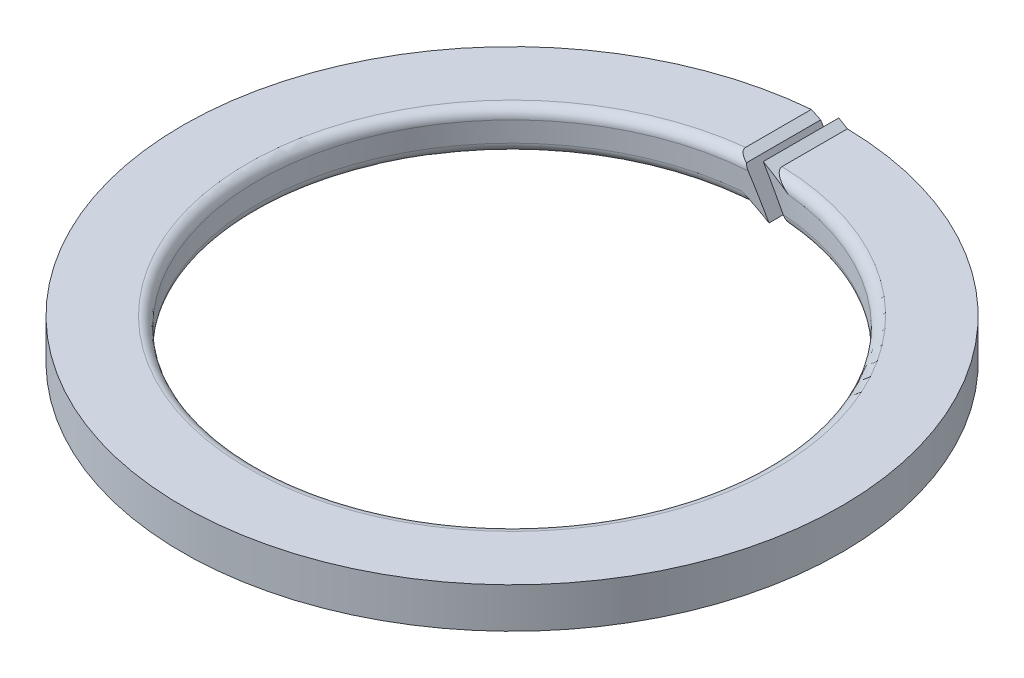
from build123d import *

# Parameters (mm, degrees)
BODYSKE_W       = 15
BODYSKE_H       = 20
CUT_EXTRASKE_W  = 131
CUT_EXTRASKE_H  = 6
CUT_EXTRA_DEPTH = 94.16920092
TYPE_A_DEPTH    = 94.16920092
FILLET1_R       = 2


with BuildPart() as part:
    # BodySke → BaseBody (revolve)
    with BuildSketch(Plane.XY, mode=Mode.PRIVATE) as basebody_sk:
        with Locations((58, 0)):
            Rectangle(BODYSKE_W, BODYSKE_H)
    revolve(basebody_sk.sketch.rotate(Axis((0, 0, 0), (0, 1, 0)), 90), axis=Axis((0, 0, 0), (0, 1, 0)))

    # Cut-ExtraSke → Cut-Extra (cut, through all)
    with BuildSketch(Plane.XY):
        with Locations((0, -7)):
            Rectangle(CUT_EXTRASKE_W, CUT_EXTRASKE_H)
        with Locations((0, 7)):
            Rectangle(CUT_EXTRASKE_W, CUT_EXTRASKE_H)
    extrude(amount=CUT_EXTRA_DEPTH, mode=Mode.SUBTRACT)

    # ASke → Type-A (cut, through all)
    with BuildSketch(Plane.XY):
        Polygon((0.577350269, -5), (-1.154700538, -4), (-65.5, -4), (-65.5, -10), (65.5, -10), (65.5, -4), (5.773502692, -4), (4.041451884, -3), (-0.577350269, 5), (1.154700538, 4), (65.5, 4), (65.5, 10), (-65.5, 10), (-65.5, 4), (-5.773502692, 4), (-4.041451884, 3), align=None)
    extrude(amount=-TYPE_A_DEPTH, mode=Mode.SUBTRACT)

    # Fillet1
    fillet1_edges = [part.edges().sort_by_distance(p)[0] for p in [
        (-2.314865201, -4, 50.446916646),
        (2.314865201, 4, 50.446916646),
    ]]
    fillet(fillet1_edges, radius=FILLET1_R)


solid = part.part
